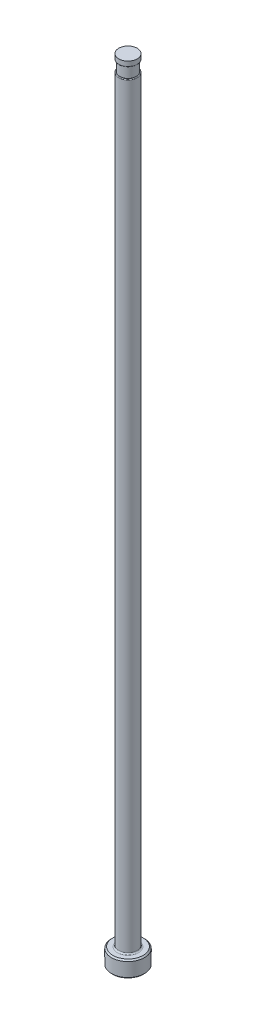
ISO-10303-21;
HEADER;
FILE_DESCRIPTION(('STEP AP214'),'2;1');
FILE_NAME('part.step','',(''),(''),'','','');
FILE_SCHEMA(('AUTOMOTIVE_DESIGN { 1 0 10303 214 1 1 1 1 }'));
ENDSEC;
DATA;
#1=APPLICATION_CONTEXT('core data for automotive mechanical design processes');
#2=APPLICATION_PROTOCOL_DEFINITION('international standard','automotive_design',2000,#1);
#3=PRODUCT_CONTEXT('',#1,'mechanical');
#4=PRODUCT('Part','Part','',(#3));
#5=PRODUCT_RELATED_PRODUCT_CATEGORY('part','',(#4));
#6=PRODUCT_DEFINITION_FORMATION('','',#4);
#7=PRODUCT_DEFINITION_CONTEXT('part definition',#1,'design');
#8=PRODUCT_DEFINITION('design','',#6,#7);
#9=PRODUCT_DEFINITION_SHAPE('','',#8);
#10=(LENGTH_UNIT() NAMED_UNIT(*) SI_UNIT(.MILLI.,.METRE.));
#11=(NAMED_UNIT(*) PLANE_ANGLE_UNIT() SI_UNIT($,.RADIAN.));
#12=(NAMED_UNIT(*) SI_UNIT($,.STERADIAN.) SOLID_ANGLE_UNIT());
#13=UNCERTAINTY_MEASURE_WITH_UNIT(LENGTH_MEASURE(1.E-05),#10,'distance_accuracy_value','');
#14=(GEOMETRIC_REPRESENTATION_CONTEXT(3) GLOBAL_UNCERTAINTY_ASSIGNED_CONTEXT((#13)) GLOBAL_UNIT_ASSIGNED_CONTEXT((#10,
#11,#12)) REPRESENTATION_CONTEXT('',''));
#15=CARTESIAN_POINT('',(0.,0.,0.));
#16=DIRECTION('',(0.,0.,1.));
#17=DIRECTION('',(1.,0.,0.));
#18=AXIS2_PLACEMENT_3D('',#15,#16,#17);
#19=CARTESIAN_POINT('',(-1.78561999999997,151.384,0.));
#20=DIRECTION('',(0.,1.,0.));
#21=DIRECTION('',(0.,0.,1.));
#22=AXIS2_PLACEMENT_3D('',#19,#20,#21);
#23=PLANE('',#22);
#24=CARTESIAN_POINT('',(0.,151.384,0.));
#25=DIRECTION('',(0.,1.,0.));
#26=DIRECTION('',(0.,0.,1.));
#27=AXIS2_PLACEMENT_3D('',#24,#25,#26);
#28=CIRCLE('',#27,1.65353999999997);
#29=CARTESIAN_POINT('',(0.,151.384,1.65353999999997));
#30=VERTEX_POINT('',#29);
#31=EDGE_CURVE('E11',#30,#30,#28,.F.);
#32=ORIENTED_EDGE('',*,*,#31,.T.);
#33=EDGE_LOOP('',(#32));
#34=FACE_BOUND('',#33,.T.);
#35=CARTESIAN_POINT('',(0.,151.384,0.));
#36=DIRECTION('',(0.,1.,0.));
#37=DIRECTION('',(0.,0.,1.));
#38=AXIS2_PLACEMENT_3D('',#35,#36,#37);
#39=CIRCLE('',#38,1.58241999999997);
#40=CARTESIAN_POINT('',(0.,151.384,1.58241999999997));
#41=VERTEX_POINT('',#40);
#42=EDGE_CURVE('E78',#41,#41,#39,.T.);
#43=ORIENTED_EDGE('',*,*,#42,.T.);
#44=EDGE_LOOP('',(#43));
#45=FACE_BOUND('',#44,.T.);
#46=ADVANCED_FACE('F36',(#34,#45),#23,.F.);
#47=CARTESIAN_POINT('',(0.,259.958771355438,0.));
#48=DIRECTION('',(0.,1.,0.));
#49=DIRECTION('',(0.,0.,1.));
#50=AXIS2_PLACEMENT_3D('',#47,#48,#49);
#51=CYLINDRICAL_SURFACE('',#50,1.78561999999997);
#52=DIRECTION('',(0.,1.,0.));
#53=VECTOR('',#52,1.);
#54=CARTESIAN_POINT('',(-1.58241999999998,259.958771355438,-0.827276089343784));
#55=LINE('',#54,#53);
#56=CARTESIAN_POINT('',(-1.58241999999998,149.225,-0.827276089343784));
#57=VERTEX_POINT('',#56);
#58=CARTESIAN_POINT('',(-1.58241999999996,86.868,-0.827276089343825));
#59=VERTEX_POINT('',#58);
#60=EDGE_CURVE('E73',#57,#59,#55,.F.);
#61=ORIENTED_EDGE('',*,*,#60,.F.);
#62=CARTESIAN_POINT('',(0.,149.225,0.));
#63=DIRECTION('',(0.,-1.,0.));
#64=DIRECTION('',(0.,0.,-1.));
#65=AXIS2_PLACEMENT_3D('',#62,#63,#64);
#66=CIRCLE('',#65,1.78561999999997);
#67=CARTESIAN_POINT('',(-1.58241999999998,149.225,0.827276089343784));
#68=VERTEX_POINT('',#67);
#69=EDGE_CURVE('E51',#57,#68,#66,.T.);
#70=ORIENTED_EDGE('',*,*,#69,.T.);
#71=DIRECTION('',(0.,1.,0.));
#72=VECTOR('',#71,1.);
#73=CARTESIAN_POINT('',(-1.58241999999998,259.958771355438,0.827276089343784));
#74=LINE('',#73,#72);
#75=CARTESIAN_POINT('',(-1.58241999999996,86.868,0.827276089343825));
#76=VERTEX_POINT('',#75);
#77=EDGE_CURVE('E84',#76,#68,#74,.T.);
#78=ORIENTED_EDGE('',*,*,#77,.F.);
#79=CARTESIAN_POINT('',(-1.58241999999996,86.868,-0.827276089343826));
#80=CARTESIAN_POINT('',(-1.58241859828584,86.83330589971,-0.827270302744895));
#81=CARTESIAN_POINT('',(-1.58298930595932,86.7986242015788,-0.826188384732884));
#82=CARTESIAN_POINT('',(-1.58525672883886,86.7294213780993,-0.821832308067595));
#83=CARTESIAN_POINT('',(-1.58695392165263,86.6949003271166,-0.818557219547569));
#84=CARTESIAN_POINT('',(-1.59374670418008,86.5912224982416,-0.805306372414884));
#85=CARTESIAN_POINT('',(-1.60054304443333,86.5225662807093,-0.791903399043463));
#86=CARTESIAN_POINT('',(-1.6181445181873,86.3882279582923,-0.755289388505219));
#87=CARTESIAN_POINT('',(-1.62896089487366,86.3225547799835,-0.732050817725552));
#88=CARTESIAN_POINT('',(-1.6535134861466,86.1968437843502,-0.674760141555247));
#89=CARTESIAN_POINT('',(-1.66723753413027,86.1367839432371,-0.640752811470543));
#90=CARTESIAN_POINT('',(-1.69108481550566,86.0435410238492,-0.574000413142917));
#91=CARTESIAN_POINT('',(-1.70092185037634,86.0079825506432,-0.544463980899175));
#92=CARTESIAN_POINT('',(-1.72024188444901,85.9420696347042,-0.479935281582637));
#93=CARTESIAN_POINT('',(-1.72972525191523,85.9117096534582,-0.444948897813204));
#94=CARTESIAN_POINT('',(-1.74591517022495,85.8619989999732,-0.375854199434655));
#95=CARTESIAN_POINT('',(-1.75282315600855,85.8416636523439,-0.342504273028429));
#96=CARTESIAN_POINT('',(-1.76503091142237,85.806596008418,-0.272685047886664));
#97=CARTESIAN_POINT('',(-1.7703313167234,85.7918614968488,-0.236216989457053));
#98=CARTESIAN_POINT('',(-1.77876737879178,85.7687234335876,-0.160839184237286));
#99=CARTESIAN_POINT('',(-1.78189089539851,85.7603553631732,-0.121917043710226));
#100=CARTESIAN_POINT('',(-1.78553515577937,85.7506126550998,-0.0430875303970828));
#101=CARTESIAN_POINT('',(-1.78605699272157,85.7492350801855,-0.00318057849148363));
#102=CARTESIAN_POINT('',(-1.78451570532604,85.753340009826,0.0723170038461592));
#103=CARTESIAN_POINT('',(-1.78269870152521,85.7581692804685,0.107950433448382));
#104=CARTESIAN_POINT('',(-1.77708661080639,85.7733299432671,0.177853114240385));
#105=CARTESIAN_POINT('',(-1.7732916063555,85.7836611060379,0.212122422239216));
#106=CARTESIAN_POINT('',(-1.76403207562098,85.8094906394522,0.278893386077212));
#107=CARTESIAN_POINT('',(-1.75854739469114,85.8250516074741,0.311367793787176));
#108=CARTESIAN_POINT('',(-1.74640529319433,85.8606424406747,0.373513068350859));
#109=CARTESIAN_POINT('',(-1.73974732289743,85.8806744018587,0.403182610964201));
#110=CARTESIAN_POINT('',(-1.72309018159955,85.9328692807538,0.470106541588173));
#111=CARTESIAN_POINT('',(-1.7127837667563,85.9667475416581,0.50595017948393));
#112=CARTESIAN_POINT('',(-1.69205421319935,86.0399822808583,0.571469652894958));
#113=CARTESIAN_POINT('',(-1.68163090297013,86.079348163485,0.601134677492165));
#114=CARTESIAN_POINT('',(-1.65852628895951,86.1747765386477,0.662663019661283));
#115=CARTESIAN_POINT('',(-1.64612995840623,86.2322622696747,0.692421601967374));
#116=CARTESIAN_POINT('',(-1.62408795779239,86.3516981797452,0.742649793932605));
#117=CARTESIAN_POINT('',(-1.61444888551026,86.4136586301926,0.763097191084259));
#118=CARTESIAN_POINT('',(-1.5986900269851,86.5406358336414,0.79558606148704));
#119=CARTESIAN_POINT('',(-1.59259533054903,86.6056709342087,0.807567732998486));
#120=CARTESIAN_POINT('',(-1.58649588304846,86.7038700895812,0.819442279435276));
#121=CARTESIAN_POINT('',(-1.58496990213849,86.7366111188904,0.822384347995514));
#122=CARTESIAN_POINT('',(-1.58293155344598,86.8022312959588,0.826298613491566));
#123=CARTESIAN_POINT('',(-1.58241884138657,86.8351103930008,0.827271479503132));
#124=CARTESIAN_POINT('',(-1.58241999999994,86.8679999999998,0.827276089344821));
#125=B_SPLINE_CURVE_WITH_KNOTS('',3,(#79,#80,#81,#82,#83,#84,#85,#86,#87,#88,#89,#90,#91,#92,
#93,#94,#95,#96,#97,#98,#99,#100,#101,#102,#103,#104,#105,#106,#107,#108,#109,#110,#111,#112,
#113,#114,#115,#116,#117,#118,#119,#120,#121,#122,#123,#124),.UNSPECIFIED.,.F.,.F.,(4,2,2,2,2,2,
2,2,2,2,2,2,2,2,2,2,2,2,2,2,2,2,4),(0.,0.104035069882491,0.208114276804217,0.418101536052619,
0.6286805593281,0.838395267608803,0.979683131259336,1.12081951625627,1.23932997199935,
1.35779350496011,1.47691251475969,1.59598146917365,1.70348686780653,1.81098778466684,
1.91982417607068,2.02871169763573,2.17903977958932,2.32962872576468,2.5262950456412,
2.72342810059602,2.92194014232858,3.02060242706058,3.1192311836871),.UNSPECIFIED.);
#126=EDGE_CURVE('E81',#59,#76,#125,.T.);
#127=ORIENTED_EDGE('',*,*,#126,.F.);
#128=EDGE_LOOP('',(#61,#70,#78,#127));
#129=FACE_BOUND('',#128,.T.);
#130=CARTESIAN_POINT('',(0.,3.42900000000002,0.));
#131=DIRECTION('',(0.,1.,0.));
#132=DIRECTION('',(0.,0.,1.));
#133=AXIS2_PLACEMENT_3D('',#130,#131,#132);
#134=CIRCLE('',#133,1.78561999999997);
#135=CARTESIAN_POINT('',(0.,3.42900000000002,1.78561999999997));
#136=VERTEX_POINT('',#135);
#137=EDGE_CURVE('E116',#136,#136,#134,.T.);
#138=ORIENTED_EDGE('',*,*,#137,.T.);
#139=EDGE_LOOP('',(#138));
#140=FACE_BOUND('',#139,.T.);
#141=ADVANCED_FACE('F82',(#129,#140),#51,.T.);
#142=CARTESIAN_POINT('',(0.,0.,0.));
#143=DIRECTION('',(0.,-1.,0.));
#144=DIRECTION('',(0.,0.,-1.));
#145=AXIS2_PLACEMENT_3D('',#142,#143,#144);
#146=PLANE('',#145);
#147=CARTESIAN_POINT('',(0.,0.,0.));
#148=DIRECTION('',(0.,-1.,0.));
#149=DIRECTION('',(0.,0.,-1.));
#150=AXIS2_PLACEMENT_3D('',#147,#148,#149);
#151=CIRCLE('',#150,2.92099999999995);
#152=CARTESIAN_POINT('',(0.,0.,-2.92099999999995));
#153=VERTEX_POINT('',#152);
#154=EDGE_CURVE('E113',#153,#153,#151,.T.);
#155=ORIENTED_EDGE('',*,*,#154,.T.);
#156=EDGE_LOOP('',(#155));
#157=FACE_BOUND('',#156,.T.);
#158=ADVANCED_FACE('F192',(#157),#146,.T.);
#159=CARTESIAN_POINT('',(0.,259.958771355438,0.));
#160=DIRECTION('',(0.,1.,0.));
#161=DIRECTION('',(0.,0.,1.));
#162=AXIS2_PLACEMENT_3D('',#159,#160,#161);
#163=CYLINDRICAL_SURFACE('',#162,3.17499999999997);
#164=CARTESIAN_POINT('',(0.,2.92100000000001,0.));
#165=DIRECTION('',(0.,1.,0.));
#166=DIRECTION('',(0.,0.,1.));
#167=AXIS2_PLACEMENT_3D('',#164,#165,#166);
#168=CIRCLE('',#167,3.17499999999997);
#169=CARTESIAN_POINT('',(0.,2.92100000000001,3.17499999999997));
#170=VERTEX_POINT('',#169);
#171=EDGE_CURVE('E110',#170,#170,#168,.F.);
#172=ORIENTED_EDGE('',*,*,#171,.T.);
#173=EDGE_LOOP('',(#172));
#174=FACE_BOUND('',#173,.T.);
#175=CARTESIAN_POINT('',(0.,0.254000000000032,0.));
#176=DIRECTION('',(0.,-1.,0.));
#177=DIRECTION('',(0.,0.,-1.));
#178=AXIS2_PLACEMENT_3D('',#175,#176,#177);
#179=CIRCLE('',#178,3.17499999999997);
#180=CARTESIAN_POINT('',(0.,0.254000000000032,-3.17499999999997));
#181=VERTEX_POINT('',#180);
#182=EDGE_CURVE('E107',#181,#181,#179,.F.);
#183=ORIENTED_EDGE('',*,*,#182,.T.);
#184=EDGE_LOOP('',(#183));
#185=FACE_BOUND('',#184,.T.);
#186=ADVANCED_FACE('F195',(#174,#185),#163,.T.);
#187=CARTESIAN_POINT('',(-3.17499999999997,3.175,0.));
#188=DIRECTION('',(0.,1.,0.));
#189=DIRECTION('',(0.,0.,1.));
#190=AXIS2_PLACEMENT_3D('',#187,#188,#189);
#191=PLANE('',#190);
#192=CARTESIAN_POINT('',(0.,3.175,0.));
#193=DIRECTION('',(0.,1.,0.));
#194=DIRECTION('',(0.,0.,1.));
#195=AXIS2_PLACEMENT_3D('',#192,#193,#194);
#196=CIRCLE('',#195,2.03961999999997);
#197=CARTESIAN_POINT('',(0.,3.175,2.03961999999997));
#198=VERTEX_POINT('',#197);
#199=EDGE_CURVE('E87',#198,#198,#196,.F.);
#200=ORIENTED_EDGE('',*,*,#199,.T.);
#201=EDGE_LOOP('',(#200));
#202=FACE_BOUND('',#201,.T.);
#203=CARTESIAN_POINT('',(0.,3.175,0.));
#204=DIRECTION('',(0.,1.,0.));
#205=DIRECTION('',(0.,0.,1.));
#206=AXIS2_PLACEMENT_3D('',#203,#204,#205);
#207=CIRCLE('',#206,2.92099999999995);
#208=CARTESIAN_POINT('',(0.,3.175,2.92099999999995));
#209=VERTEX_POINT('',#208);
#210=EDGE_CURVE('E104',#209,#209,#207,.T.);
#211=ORIENTED_EDGE('',*,*,#210,.T.);
#212=EDGE_LOOP('',(#211));
#213=FACE_BOUND('',#212,.T.);
#214=ADVANCED_FACE('F190',(#202,#213),#191,.T.);
#215=CARTESIAN_POINT('',(0.,3.17499999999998,0.));
#216=DIRECTION('',(0.,-1.,0.));
#217=DIRECTION('',(0.,0.,-1.));
#218=AXIS2_PLACEMENT_3D('',#215,#216,#217);
#219=CONICAL_SURFACE('',#218,2.92099999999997,0.7853981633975);
#220=ORIENTED_EDGE('',*,*,#171,.F.);
#221=EDGE_LOOP('',(#220));
#222=FACE_BOUND('',#221,.T.);
#223=ORIENTED_EDGE('',*,*,#210,.F.);
#224=EDGE_LOOP('',(#223));
#225=FACE_BOUND('',#224,.T.);
#226=ADVANCED_FACE('F186',(#222,#225),#219,.T.);
#227=CARTESIAN_POINT('',(0.,0.254000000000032,0.));
#228=DIRECTION('',(0.,1.,0.));
#229=DIRECTION('',(0.,0.,1.));
#230=AXIS2_PLACEMENT_3D('',#227,#228,#229);
#231=CONICAL_SURFACE('',#230,3.17499999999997,0.785398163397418);
#232=ORIENTED_EDGE('',*,*,#154,.F.);
#233=EDGE_LOOP('',(#232));
#234=FACE_BOUND('',#233,.T.);
#235=ORIENTED_EDGE('',*,*,#182,.F.);
#236=EDGE_LOOP('',(#235));
#237=FACE_BOUND('',#236,.T.);
#238=ADVANCED_FACE('F182',(#234,#237),#231,.T.);
#239=CARTESIAN_POINT('',(0.,3.42900000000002,0.));
#240=DIRECTION('',(0.,1.,0.));
#241=DIRECTION('',(0.,0.,1.));
#242=AXIS2_PLACEMENT_3D('',#239,#240,#241);
#243=TOROIDAL_SURFACE('',#242,2.03961999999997,0.254);
#244=ORIENTED_EDGE('',*,*,#199,.F.);
#245=EDGE_LOOP('',(#244));
#246=FACE_BOUND('',#245,.T.);
#247=ORIENTED_EDGE('',*,*,#137,.F.);
#248=EDGE_LOOP('',(#247));
#249=FACE_BOUND('',#248,.T.);
#250=ADVANCED_FACE('F147',(#246,#249),#243,.F.);
#251=CARTESIAN_POINT('',(-1.78561999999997,149.352,0.));
#252=DIRECTION('',(0.,-1.,0.));
#253=DIRECTION('',(0.,0.,-1.));
#254=AXIS2_PLACEMENT_3D('',#251,#252,#253);
#255=PLANE('',#254);
#256=DIRECTION('',(0.,0.,1.));
#257=VECTOR('',#256,1.);
#258=CARTESIAN_POINT('',(-1.58241999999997,149.352,0.));
#259=LINE('',#258,#257);
#260=CARTESIAN_POINT('',(-1.58241999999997,149.352,0.));
#261=VERTEX_POINT('',#260);
#262=CARTESIAN_POINT('',(-1.58241999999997,149.352,0.496957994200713));
#263=VERTEX_POINT('',#262);
#264=EDGE_CURVE('E90',#261,#263,#259,.T.);
#265=ORIENTED_EDGE('',*,*,#264,.T.);
#266=CARTESIAN_POINT('',(0.,149.352,0.));
#267=DIRECTION('',(0.,-1.,0.));
#268=DIRECTION('',(0.,0.,-1.));
#269=AXIS2_PLACEMENT_3D('',#266,#267,#268);
#270=CIRCLE('',#269,1.65861999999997);
#271=CARTESIAN_POINT('',(-1.58241999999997,149.352,-0.496957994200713));
#272=VERTEX_POINT('',#271);
#273=EDGE_CURVE('E86',#263,#272,#270,.F.);
#274=ORIENTED_EDGE('',*,*,#273,.T.);
#275=EDGE_CURVE('E79',#272,#261,#259,.T.);
#276=ORIENTED_EDGE('',*,*,#275,.T.);
#277=CARTESIAN_POINT('',(0.,149.352,0.));
#278=DIRECTION('',(0.,1.,0.));
#279=DIRECTION('',(0.,0.,1.));
#280=AXIS2_PLACEMENT_3D('',#277,#278,#279);
#281=CIRCLE('',#280,1.58241999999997);
#282=EDGE_CURVE('E101',#261,#261,#281,.T.);
#283=ORIENTED_EDGE('',*,*,#282,.F.);
#284=EDGE_LOOP('',(#265,#274,#276,#283));
#285=FACE_BOUND('',#284,.T.);
#286=ADVANCED_FACE('F144',(#285),#255,.F.);
#287=CARTESIAN_POINT('',(0.,153.448281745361,0.));
#288=DIRECTION('',(0.,1.,0.));
#289=DIRECTION('',(0.,0.,1.));
#290=AXIS2_PLACEMENT_3D('',#287,#288,#289);
#291=CYLINDRICAL_SURFACE('',#290,1.58241999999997);
#292=ORIENTED_EDGE('',*,*,#42,.F.);
#293=EDGE_LOOP('',(#292));
#294=FACE_BOUND('',#293,.T.);
#295=ORIENTED_EDGE('',*,*,#282,.T.);
#296=EDGE_LOOP('',(#295));
#297=FACE_BOUND('',#296,.T.);
#298=ADVANCED_FACE('F141',(#294,#297),#291,.T.);
#299=CARTESIAN_POINT('',(-1.58241999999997,150.368,-3.17499999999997));
#300=DIRECTION('',(1.,0.,0.));
#301=DIRECTION('',(0.,1.,0.));
#302=AXIS2_PLACEMENT_3D('',#299,#300,#301);
#303=PLANE('',#302);
#304=ORIENTED_EDGE('',*,*,#275,.F.);
#305=CARTESIAN_POINT('',(-1.58241999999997,149.352,-0.496957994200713));
#306=CARTESIAN_POINT('',(-1.58241999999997,149.351990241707,-0.513789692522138));
#307=CARTESIAN_POINT('',(-1.58241999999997,149.35169820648,-0.530633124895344));
#308=CARTESIAN_POINT('',(-1.58241999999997,149.350318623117,-0.564374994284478));
#309=CARTESIAN_POINT('',(-1.58241999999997,149.349226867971,-0.581273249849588));
#310=CARTESIAN_POINT('',(-1.58241999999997,149.346012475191,-0.614973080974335));
#311=CARTESIAN_POINT('',(-1.58241999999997,149.343890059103,-0.631774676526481));
#312=CARTESIAN_POINT('',(-1.58241999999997,149.338280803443,-0.665126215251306));
#313=CARTESIAN_POINT('',(-1.58241999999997,149.334797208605,-0.681676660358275));
#314=CARTESIAN_POINT('',(-1.58241999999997,149.328084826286,-0.706389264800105));
#315=CARTESIAN_POINT('',(-1.58241999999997,149.325547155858,-0.71473825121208));
#316=CARTESIAN_POINT('',(-1.58241999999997,149.31984368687,-0.73126480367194));
#317=CARTESIAN_POINT('',(-1.58241999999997,149.316675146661,-0.73944144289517));
#318=CARTESIAN_POINT('',(-1.58241999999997,149.308581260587,-0.757712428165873));
#319=CARTESIAN_POINT('',(-1.58241999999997,149.303412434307,-0.767701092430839));
#320=CARTESIAN_POINT('',(-1.58241999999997,149.291398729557,-0.786606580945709));
#321=CARTESIAN_POINT('',(-1.58241999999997,149.284567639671,-0.795531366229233));
#322=CARTESIAN_POINT('',(-1.58241999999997,149.273582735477,-0.806320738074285));
#323=CARTESIAN_POINT('',(-1.58241999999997,149.270377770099,-0.809143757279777));
#324=CARTESIAN_POINT('',(-1.58241999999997,149.263610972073,-0.814338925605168));
#325=CARTESIAN_POINT('',(-1.58241999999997,149.260048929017,-0.816710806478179));
#326=CARTESIAN_POINT('',(-1.58241999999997,149.252529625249,-0.820873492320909));
#327=CARTESIAN_POINT('',(-1.58241999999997,149.248567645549,-0.822655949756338));
#328=CARTESIAN_POINT('',(-1.58241999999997,149.24037382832,-0.825404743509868));
#329=CARTESIAN_POINT('',(-1.58241999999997,149.236143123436,-0.826374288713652));
#330=CARTESIAN_POINT('',(-1.58241999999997,149.230726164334,-0.82700858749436));
#331=CARTESIAN_POINT('',(-1.58241999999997,149.229583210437,-0.827108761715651));
#332=CARTESIAN_POINT('',(-1.58241999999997,149.227293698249,-0.827242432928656));
#333=CARTESIAN_POINT('',(-1.58241999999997,149.226147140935,-0.827275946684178));
#334=CARTESIAN_POINT('',(-1.58241999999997,149.225,-0.827276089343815));
#335=B_SPLINE_CURVE_WITH_KNOTS('',3,(#305,#306,#307,#308,#309,#310,#311,#312,#313,#314,#315,
#316,#317,#318,#319,#320,#321,#322,#323,#324,#325,#326,#327,#328,#329,#330,#331,#332,#333,#334),
.UNSPECIFIED.,.F.,.F.,(4,2,2,2,2,2,2,2,2,2,2,2,2,2,4),(0.,0.0505111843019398,0.101290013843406,
0.15205793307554,0.202705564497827,0.228865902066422,0.255142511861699,0.288792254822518,
0.322171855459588,0.334955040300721,0.347745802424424,0.360710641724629,0.373624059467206,
0.377064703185,0.380504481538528),.UNSPECIFIED.);
#336=EDGE_CURVE('E59',#272,#57,#335,.T.);
#337=ORIENTED_EDGE('',*,*,#336,.T.);
#338=ORIENTED_EDGE('',*,*,#60,.T.);
#339=DIRECTION('',(0.,0.,1.));
#340=VECTOR('',#339,1.);
#341=CARTESIAN_POINT('',(-1.58241999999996,86.868,-3.17499999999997));
#342=LINE('',#341,#340);
#343=EDGE_CURVE('E77',#59,#76,#342,.T.);
#344=ORIENTED_EDGE('',*,*,#343,.T.);
#345=ORIENTED_EDGE('',*,*,#77,.T.);
#346=CARTESIAN_POINT('',(-1.58241999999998,149.225,0.827276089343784));
#347=CARTESIAN_POINT('',(-1.58241999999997,149.228578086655,0.827284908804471));
#348=CARTESIAN_POINT('',(-1.58241999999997,149.232145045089,0.826950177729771));
#349=CARTESIAN_POINT('',(-1.58241999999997,149.239132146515,0.825674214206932));
#350=CARTESIAN_POINT('',(-1.58241999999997,149.242553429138,0.824739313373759));
#351=CARTESIAN_POINT('',(-1.58241999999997,149.249944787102,0.822072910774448));
#352=CARTESIAN_POINT('',(-1.58241999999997,149.253866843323,0.820210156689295));
#353=CARTESIAN_POINT('',(-1.58241999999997,149.261366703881,0.815871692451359));
#354=CARTESIAN_POINT('',(-1.58241999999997,149.264942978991,0.813393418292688));
#355=CARTESIAN_POINT('',(-1.58241999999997,149.273559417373,0.806534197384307));
#356=CARTESIAN_POINT('',(-1.58241999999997,149.278353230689,0.801846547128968));
#357=CARTESIAN_POINT('',(-1.58241999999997,149.287183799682,0.791817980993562));
#358=CARTESIAN_POINT('',(-1.58241999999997,149.291219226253,0.786475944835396));
#359=CARTESIAN_POINT('',(-1.58241999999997,149.301959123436,0.770471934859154));
#360=CARTESIAN_POINT('',(-1.58241999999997,149.307868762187,0.759282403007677));
#361=CARTESIAN_POINT('',(-1.58241999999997,149.318145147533,0.736160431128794));
#362=CARTESIAN_POINT('',(-1.58241999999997,149.322499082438,0.724222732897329));
#363=CARTESIAN_POINT('',(-1.58241999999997,149.331780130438,0.694353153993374));
#364=CARTESIAN_POINT('',(-1.58241999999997,149.336032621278,0.676214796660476));
#365=CARTESIAN_POINT('',(-1.58241999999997,149.342803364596,0.639581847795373));
#366=CARTESIAN_POINT('',(-1.58241999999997,149.345315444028,0.621086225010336));
#367=CARTESIAN_POINT('',(-1.58241999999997,149.348962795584,0.584931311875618));
#368=CARTESIAN_POINT('',(-1.58241999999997,149.350162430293,0.567278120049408));
#369=CARTESIAN_POINT('',(-1.58241999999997,149.351671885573,0.532064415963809));
#370=CARTESIAN_POINT('',(-1.58241999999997,149.351988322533,0.514504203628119));
#371=CARTESIAN_POINT('',(-1.58241999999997,149.352,0.496957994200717));
#372=B_SPLINE_CURVE_WITH_KNOTS('',3,(#346,#347,#348,#349,#350,#351,#352,#353,#354,#355,#356,
#357,#358,#359,#360,#361,#362,#363,#364,#365,#366,#367,#368,#369,#370,#371),.UNSPECIFIED.,.F.,
.F.,(4,2,2,2,2,2,2,2,2,2,2,2,4),(0.,0.0107006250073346,0.0212901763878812,0.0342440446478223,
0.0472528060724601,0.0672536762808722,0.08728927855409,0.125039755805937,0.163094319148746,
0.218841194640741,0.274784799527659,0.327841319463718,0.380499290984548),.UNSPECIFIED.);
#373=EDGE_CURVE('E172',#68,#263,#372,.T.);
#374=ORIENTED_EDGE('',*,*,#373,.T.);
#375=ORIENTED_EDGE('',*,*,#264,.F.);
#376=EDGE_LOOP('',(#304,#337,#338,#344,#345,#374,#375));
#377=FACE_BOUND('',#376,.T.);
#378=ADVANCED_FACE('F75',(#377),#303,.F.);
#379=CARTESIAN_POINT('',(-4.75741999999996,86.868,-3.17499999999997));
#380=DIRECTION('',(0.,0.,1.));
#381=DIRECTION('',(1.,0.,0.));
#382=AXIS2_PLACEMENT_3D('',#379,#380,#381);
#383=CYLINDRICAL_SURFACE('',#382,3.175);
#384=ORIENTED_EDGE('',*,*,#343,.F.);
#385=ORIENTED_EDGE('',*,*,#126,.T.);
#386=EDGE_LOOP('',(#384,#385));
#387=FACE_BOUND('',#386,.T.);
#388=ADVANCED_FACE('F89',(#387),#383,.F.);
#389=CARTESIAN_POINT('',(0.,152.687735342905,0.));
#390=DIRECTION('',(0.,1.,0.));
#391=DIRECTION('',(0.,0.,1.));
#392=AXIS2_PLACEMENT_3D('',#389,#390,#391);
#393=CYLINDRICAL_SURFACE('',#392,1.78053999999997);
#394=CARTESIAN_POINT('',(0.,151.511,0.));
#395=DIRECTION('',(0.,1.,0.));
#396=DIRECTION('',(0.,0.,1.));
#397=AXIS2_PLACEMENT_3D('',#394,#395,#396);
#398=CIRCLE('',#397,1.78053999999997);
#399=CARTESIAN_POINT('',(0.,151.511,1.78053999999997));
#400=VERTEX_POINT('',#399);
#401=EDGE_CURVE('E44',#400,#400,#398,.T.);
#402=ORIENTED_EDGE('',*,*,#401,.T.);
#403=EDGE_LOOP('',(#402));
#404=FACE_BOUND('',#403,.T.);
#405=CARTESIAN_POINT('',(0.,152.4,0.));
#406=DIRECTION('',(0.,1.,0.));
#407=DIRECTION('',(0.,0.,1.));
#408=AXIS2_PLACEMENT_3D('',#405,#406,#407);
#409=CIRCLE('',#408,1.78053999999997);
#410=CARTESIAN_POINT('',(0.,152.4,1.78053999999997));
#411=VERTEX_POINT('',#410);
#412=EDGE_CURVE('E91',#411,#411,#409,.T.);
#413=ORIENTED_EDGE('',*,*,#412,.F.);
#414=EDGE_LOOP('',(#413));
#415=FACE_BOUND('',#414,.T.);
#416=ADVANCED_FACE('F135',(#404,#415),#393,.T.);
#417=CARTESIAN_POINT('',(-1.78561999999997,152.4,0.));
#418=DIRECTION('',(0.,1.,0.));
#419=DIRECTION('',(0.,0.,1.));
#420=AXIS2_PLACEMENT_3D('',#417,#418,#419);
#421=PLANE('',#420);
#422=ORIENTED_EDGE('',*,*,#412,.T.);
#423=EDGE_LOOP('',(#422));
#424=FACE_BOUND('',#423,.T.);
#425=ADVANCED_FACE('F149',(#424),#421,.T.);
#426=CARTESIAN_POINT('',(0.,149.225,0.));
#427=DIRECTION('',(0.,-1.,0.));
#428=DIRECTION('',(0.,0.,-1.));
#429=AXIS2_PLACEMENT_3D('',#426,#427,#428);
#430=TOROIDAL_SURFACE('',#429,1.65861999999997,0.127);
#431=ORIENTED_EDGE('',*,*,#373,.F.);
#432=ORIENTED_EDGE('',*,*,#69,.F.);
#433=ORIENTED_EDGE('',*,*,#336,.F.);
#434=ORIENTED_EDGE('',*,*,#273,.F.);
#435=EDGE_LOOP('',(#431,#432,#433,#434));
#436=FACE_BOUND('',#435,.T.);
#437=ADVANCED_FACE('F151',(#436),#430,.T.);
#438=CARTESIAN_POINT('',(0.,151.511,0.));
#439=DIRECTION('',(0.,1.,0.));
#440=DIRECTION('',(0.,0.,1.));
#441=AXIS2_PLACEMENT_3D('',#438,#439,#440);
#442=TOROIDAL_SURFACE('',#441,1.65353999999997,0.127);
#443=ORIENTED_EDGE('',*,*,#31,.F.);
#444=EDGE_LOOP('',(#443));
#445=FACE_BOUND('',#444,.T.);
#446=ORIENTED_EDGE('',*,*,#401,.F.);
#447=EDGE_LOOP('',(#446));
#448=FACE_BOUND('',#447,.T.);
#449=ADVANCED_FACE('F38',(#445,#448),#442,.T.);
#450=CLOSED_SHELL('',(#46,#141,#158,#186,#214,#226,#238,#250,#286,#298,#378,#388,#416,#425,#437,#449));
#451=MANIFOLD_SOLID_BREP('B2',#450);
#452=ADVANCED_BREP_SHAPE_REPRESENTATION('',(#18,#451),#14);
#453=SHAPE_DEFINITION_REPRESENTATION(#9,#452);
ENDSEC;
END-ISO-10303-21;
